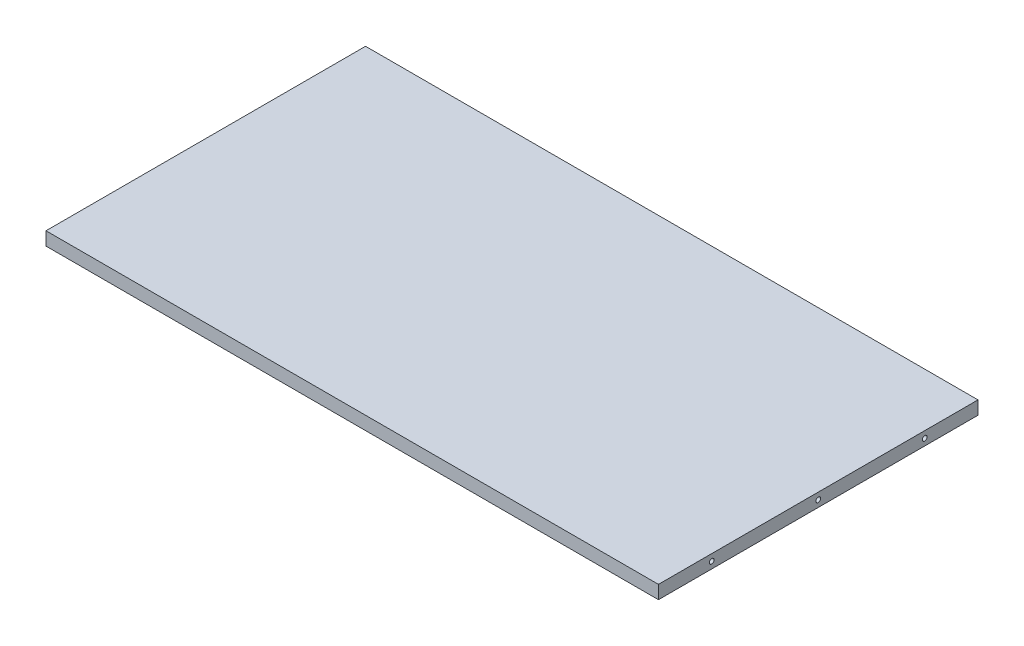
from build123d import *

# Parameters (mm, degrees)
SKETCH1_W                 = 292.1
SKETCH1_H                 = 152.4
BOSS_EXTRUDE1_DEPTH       = 6.35
F_4_40_TAPPED_HOLE1_D     = 2.2606
F_4_40_TAPPED_HOLE1_DEPTH = 7.62
F_4_40_TAPPED_HOLE1_TIP   = 0.679152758
F_4_40_TAPPED_HOLE2_D     = 2.2606
F_4_40_TAPPED_HOLE2_DEPTH = 7.62
F_4_40_TAPPED_HOLE2_TIP   = 0.679152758


with BuildPart() as part:
    # Sketch1 → Boss-Extrude1 (new body)
    with BuildSketch(Plane(origin=(0, 0, 0), x_dir=(1, 0, 0), z_dir=(0, 1, 0))):
        Rectangle(SKETCH1_W, SKETCH1_H)
    extrude(amount=BOSS_EXTRUDE1_DEPTH)

    # 4-40 Tapped Hole1
    with Locations(Plane(origin=(146.05, 0, 0), x_dir=(0, 0, -1), z_dir=(1, 0, 0))):
        with Locations((0, 3.175), (-50.8, 3.175), (50.8, 3.175)):
            Hole(F_4_40_TAPPED_HOLE1_D / 2, depth=F_4_40_TAPPED_HOLE1_DEPTH)
            with Locations((0, 0, -(F_4_40_TAPPED_HOLE1_DEPTH + F_4_40_TAPPED_HOLE1_TIP / 2))):  # 118° drill point
                Cone(0, F_4_40_TAPPED_HOLE1_D / 2, F_4_40_TAPPED_HOLE1_TIP, mode=Mode.SUBTRACT)

    # 4-40 Tapped Hole2
    with Locations(Plane.ZY.offset(146.05)):
        with Locations((0, 3.175), (50.8, 3.175), (-50.8, 3.175)):
            Hole(F_4_40_TAPPED_HOLE2_D / 2, depth=F_4_40_TAPPED_HOLE2_DEPTH)
            with Locations((0, 0, -(F_4_40_TAPPED_HOLE2_DEPTH + F_4_40_TAPPED_HOLE2_TIP / 2))):  # 118° drill point
                Cone(0, F_4_40_TAPPED_HOLE2_D / 2, F_4_40_TAPPED_HOLE2_TIP, mode=Mode.SUBTRACT)


solid = part.part
